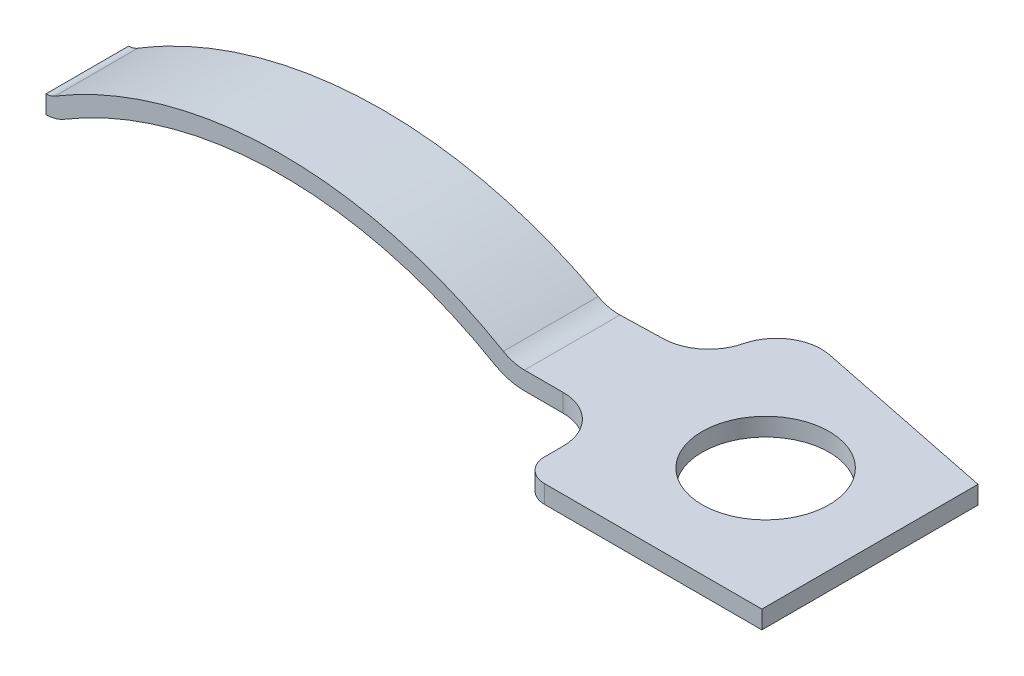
ISO-10303-21;
HEADER;
FILE_DESCRIPTION(('STEP AP214'),'2;1');
FILE_NAME('part.step','',(''),(''),'','','');
FILE_SCHEMA(('AUTOMOTIVE_DESIGN { 1 0 10303 214 1 1 1 1 }'));
ENDSEC;
DATA;
#1=APPLICATION_CONTEXT('core data for automotive mechanical design processes');
#2=APPLICATION_PROTOCOL_DEFINITION('international standard','automotive_design',2000,#1);
#3=PRODUCT_CONTEXT('',#1,'mechanical');
#4=PRODUCT('Part','Part','',(#3));
#5=PRODUCT_RELATED_PRODUCT_CATEGORY('part','',(#4));
#6=PRODUCT_DEFINITION_FORMATION('','',#4);
#7=PRODUCT_DEFINITION_CONTEXT('part definition',#1,'design');
#8=PRODUCT_DEFINITION('design','',#6,#7);
#9=PRODUCT_DEFINITION_SHAPE('','',#8);
#10=(LENGTH_UNIT() NAMED_UNIT(*) SI_UNIT(.MILLI.,.METRE.));
#11=(NAMED_UNIT(*) PLANE_ANGLE_UNIT() SI_UNIT($,.RADIAN.));
#12=(NAMED_UNIT(*) SI_UNIT($,.STERADIAN.) SOLID_ANGLE_UNIT());
#13=UNCERTAINTY_MEASURE_WITH_UNIT(LENGTH_MEASURE(1.E-05),#10,'distance_accuracy_value','');
#14=(GEOMETRIC_REPRESENTATION_CONTEXT(3) GLOBAL_UNCERTAINTY_ASSIGNED_CONTEXT((#13)) GLOBAL_UNIT_ASSIGNED_CONTEXT((#10,
#11,#12)) REPRESENTATION_CONTEXT('',''));
#15=CARTESIAN_POINT('',(0.,0.,0.));
#16=DIRECTION('',(0.,0.,1.));
#17=DIRECTION('',(1.,0.,0.));
#18=AXIS2_PLACEMENT_3D('',#15,#16,#17);
#19=CARTESIAN_POINT('',(-23.114,1.1938,-4.572));
#20=DIRECTION('',(0.,0.,1.));
#21=DIRECTION('',(1.,0.,0.));
#22=AXIS2_PLACEMENT_3D('',#19,#20,#21);
#23=CYLINDRICAL_SURFACE('',#22,1.1938);
#24=CARTESIAN_POINT('',(-23.114,1.1938,-1.5875));
#25=DIRECTION('',(0.0266571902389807,0.,0.999644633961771));
#26=DIRECTION('',(-0.999644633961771,0.,0.0266571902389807));
#27=AXIS2_PLACEMENT_3D('',#24,#25,#26);
#28=ELLIPSE('',#27,1.19422438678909,1.1938);
#29=CARTESIAN_POINT('',(-22.4993318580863,0.170402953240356,-1.60389115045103));
#30=VERTEX_POINT('',#29);
#31=CARTESIAN_POINT('',(-23.114,0.,-1.5875));
#32=VERTEX_POINT('',#31);
#33=EDGE_CURVE('E214',#30,#32,#28,.F.);
#34=ORIENTED_EDGE('',*,*,#33,.F.);
#35=DIRECTION('',(0.,0.,1.));
#36=VECTOR('',#35,1.);
#37=CARTESIAN_POINT('',(-22.4993318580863,0.170402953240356,-4.572));
#38=LINE('',#37,#36);
#39=CARTESIAN_POINT('',(-22.4993318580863,0.17040295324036,1.2065));
#40=VERTEX_POINT('',#39);
#41=EDGE_CURVE('E238',#30,#40,#38,.T.);
#42=ORIENTED_EDGE('',*,*,#41,.T.);
#43=CARTESIAN_POINT('',(-23.114,1.1938,1.2065));
#44=DIRECTION('',(0.,0.,-1.));
#45=DIRECTION('',(-1.,0.,0.));
#46=AXIS2_PLACEMENT_3D('',#43,#44,#45);
#47=CIRCLE('',#46,1.1938);
#48=CARTESIAN_POINT('',(-23.114,0.,1.2065));
#49=VERTEX_POINT('',#48);
#50=EDGE_CURVE('E201',#49,#40,#47,.F.);
#51=ORIENTED_EDGE('',*,*,#50,.F.);
#52=DIRECTION('',(0.,0.,1.));
#53=VECTOR('',#52,1.);
#54=CARTESIAN_POINT('',(-23.114,0.,-4.572));
#55=LINE('',#54,#53);
#56=EDGE_CURVE('E239',#32,#49,#55,.T.);
#57=ORIENTED_EDGE('',*,*,#56,.F.);
#58=EDGE_LOOP('',(#34,#42,#51,#57));
#59=FACE_BOUND('',#58,.T.);
#60=ADVANCED_FACE('F35',(#59),#23,.T.);
#61=CARTESIAN_POINT('',(-23.114,0.609599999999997,-4.572));
#62=DIRECTION('',(-1.,0.,0.));
#63=DIRECTION('',(0.,0.,1.));
#64=AXIS2_PLACEMENT_3D('',#61,#62,#63);
#65=PLANE('',#64);
#66=DIRECTION('',(0.,1.,0.));
#67=VECTOR('',#66,1.);
#68=CARTESIAN_POINT('',(-23.114,0.,-1.5875));
#69=LINE('',#68,#67);
#70=CARTESIAN_POINT('',(-23.114,0.609599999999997,-1.5875));
#71=VERTEX_POINT('',#70);
#72=EDGE_CURVE('E187',#32,#71,#69,.T.);
#73=ORIENTED_EDGE('',*,*,#72,.F.);
#74=ORIENTED_EDGE('',*,*,#56,.T.);
#75=DIRECTION('',(0.,1.,0.));
#76=VECTOR('',#75,1.);
#77=CARTESIAN_POINT('',(-23.114,0.,1.2065));
#78=LINE('',#77,#76);
#79=CARTESIAN_POINT('',(-23.114,0.609599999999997,1.2065));
#80=VERTEX_POINT('',#79);
#81=EDGE_CURVE('E190',#49,#80,#78,.T.);
#82=ORIENTED_EDGE('',*,*,#81,.T.);
#83=DIRECTION('',(0.,0.,1.));
#84=VECTOR('',#83,1.);
#85=CARTESIAN_POINT('',(-23.114,0.609599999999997,-4.572));
#86=LINE('',#85,#84);
#87=EDGE_CURVE('E243',#71,#80,#86,.T.);
#88=ORIENTED_EDGE('',*,*,#87,.F.);
#89=EDGE_LOOP('',(#73,#74,#82,#88));
#90=FACE_BOUND('',#89,.T.);
#91=ADVANCED_FACE('F329',(#90),#65,.T.);
#92=CARTESIAN_POINT('',(-23.114,1.1938,-4.572));
#93=DIRECTION('',(0.,0.,1.));
#94=DIRECTION('',(1.,0.,0.));
#95=AXIS2_PLACEMENT_3D('',#92,#93,#94);
#96=CYLINDRICAL_SURFACE('',#95,0.5842);
#97=CARTESIAN_POINT('',(-23.114,1.1938,-1.5875));
#98=DIRECTION('',(0.0266571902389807,0.,0.999644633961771));
#99=DIRECTION('',(-0.999644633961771,0.,0.0266571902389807));
#100=AXIS2_PLACEMENT_3D('',#97,#98,#99);
#101=ELLIPSE('',#100,0.584407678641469,0.5842);
#102=CARTESIAN_POINT('',(-22.8132049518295,0.69298867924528,-1.59552120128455));
#103=VERTEX_POINT('',#102);
#104=EDGE_CURVE('E223',#71,#103,#101,.T.);
#105=ORIENTED_EDGE('',*,*,#104,.F.);
#106=ORIENTED_EDGE('',*,*,#87,.T.);
#107=CARTESIAN_POINT('',(-23.114,1.1938,1.2065));
#108=DIRECTION('',(0.,0.,-1.));
#109=DIRECTION('',(-1.,0.,0.));
#110=AXIS2_PLACEMENT_3D('',#107,#108,#109);
#111=CIRCLE('',#110,0.5842);
#112=CARTESIAN_POINT('',(-22.8132049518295,0.69298867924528,1.2065));
#113=VERTEX_POINT('',#112);
#114=EDGE_CURVE('E210',#113,#80,#111,.T.);
#115=ORIENTED_EDGE('',*,*,#114,.F.);
#116=DIRECTION('',(0.,0.,1.));
#117=VECTOR('',#116,1.);
#118=CARTESIAN_POINT('',(-22.8132049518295,0.69298867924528,-4.572));
#119=LINE('',#118,#117);
#120=EDGE_CURVE('E246',#103,#113,#119,.T.);
#121=ORIENTED_EDGE('',*,*,#120,.F.);
#122=EDGE_LOOP('',(#105,#106,#115,#121));
#123=FACE_BOUND('',#122,.T.);
#124=ADVANCED_FACE('F335',(#123),#96,.F.);
#125=CARTESIAN_POINT('',(-15.1429312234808,-12.0777,-4.572));
#126=DIRECTION('',(0.,0.,1.));
#127=DIRECTION('',(1.,0.,0.));
#128=AXIS2_PLACEMENT_3D('',#125,#126,#127);
#129=CYLINDRICAL_SURFACE('',#128,14.8971);
#130=CARTESIAN_POINT('',(-15.1429312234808,-12.0777,-1.80006183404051));
#131=DIRECTION('',(0.0266571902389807,0.,0.999644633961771));
#132=DIRECTION('',(-0.999644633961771,0.,0.0266571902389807));
#133=AXIS2_PLACEMENT_3D('',#130,#131,#132);
#134=ELLIPSE('',#133,14.9023958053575,14.8971);
#135=CARTESIAN_POINT('',(-7.65750324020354,0.802205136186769,-1.99967324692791));
#136=VERTEX_POINT('',#135);
#137=EDGE_CURVE('E221',#103,#136,#134,.F.);
#138=ORIENTED_EDGE('',*,*,#137,.F.);
#139=ORIENTED_EDGE('',*,*,#120,.T.);
#140=CARTESIAN_POINT('',(-15.1429312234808,-12.0777,1.2065));
#141=DIRECTION('',(0.,0.,-1.));
#142=DIRECTION('',(-1.,0.,0.));
#143=AXIS2_PLACEMENT_3D('',#140,#141,#142);
#144=CIRCLE('',#143,14.8971);
#145=CARTESIAN_POINT('',(-7.65750324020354,0.802205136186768,1.2065));
#146=VERTEX_POINT('',#145);
#147=EDGE_CURVE('E208',#146,#113,#144,.F.);
#148=ORIENTED_EDGE('',*,*,#147,.F.);
#149=DIRECTION('',(0.,0.,1.));
#150=VECTOR('',#149,1.);
#151=CARTESIAN_POINT('',(-7.65750324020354,0.802205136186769,-4.572));
#152=LINE('',#151,#150);
#153=EDGE_CURVE('E249',#136,#146,#152,.T.);
#154=ORIENTED_EDGE('',*,*,#153,.F.);
#155=EDGE_LOOP('',(#138,#139,#148,#154));
#156=FACE_BOUND('',#155,.T.);
#157=ADVANCED_FACE('F363',(#156),#129,.T.);
#158=CARTESIAN_POINT('',(-6.94278206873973,2.032,-4.572));
#159=DIRECTION('',(0.,0.,1.));
#160=DIRECTION('',(1.,0.,0.));
#161=AXIS2_PLACEMENT_3D('',#158,#159,#160);
#162=CYLINDRICAL_SURFACE('',#161,1.4224);
#163=CARTESIAN_POINT('',(-6.94278206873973,2.032,-2.01873247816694));
#164=DIRECTION('',(0.0266571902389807,0.,0.999644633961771));
#165=DIRECTION('',(-0.999644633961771,0.,0.0266571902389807));
#166=AXIS2_PLACEMENT_3D('',#163,#164,#165);
#167=ELLIPSE('',#166,1.42290565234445,1.4224);
#168=CARTESIAN_POINT('',(-6.94278206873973,0.609599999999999,-2.01873247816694));
#169=VERTEX_POINT('',#168);
#170=EDGE_CURVE('E219',#136,#169,#167,.T.);
#171=ORIENTED_EDGE('',*,*,#170,.F.);
#172=ORIENTED_EDGE('',*,*,#153,.T.);
#173=CARTESIAN_POINT('',(-6.94278206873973,2.032,1.2065));
#174=DIRECTION('',(0.,0.,-1.));
#175=DIRECTION('',(-1.,0.,0.));
#176=AXIS2_PLACEMENT_3D('',#173,#174,#175);
#177=CIRCLE('',#176,1.4224);
#178=CARTESIAN_POINT('',(-6.94278206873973,0.609599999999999,1.2065));
#179=VERTEX_POINT('',#178);
#180=EDGE_CURVE('E205',#179,#146,#177,.T.);
#181=ORIENTED_EDGE('',*,*,#180,.F.);
#182=DIRECTION('',(0.,0.,1.));
#183=VECTOR('',#182,1.);
#184=CARTESIAN_POINT('',(-6.94278206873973,0.609599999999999,-4.572));
#185=LINE('',#184,#183);
#186=EDGE_CURVE('E252',#169,#179,#185,.T.);
#187=ORIENTED_EDGE('',*,*,#186,.F.);
#188=EDGE_LOOP('',(#171,#172,#181,#187));
#189=FACE_BOUND('',#188,.T.);
#190=ADVANCED_FACE('F367',(#189),#162,.F.);
#191=CARTESIAN_POINT('',(-6.94278206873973,0.609599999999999,-4.572));
#192=DIRECTION('',(0.,1.,0.));
#193=DIRECTION('',(-1.,0.,0.));
#194=AXIS2_PLACEMENT_3D('',#191,#192,#193);
#195=PLANE('',#194);
#196=DIRECTION('',(0.,0.,-1.));
#197=VECTOR('',#196,1.);
#198=CARTESIAN_POINT('',(-4.064,0.609599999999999,-4.572));
#199=LINE('',#198,#197);
#200=CARTESIAN_POINT('',(-4.064,0.609599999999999,3.4036));
#201=VERTEX_POINT('',#200);
#202=CARTESIAN_POINT('',(-4.064,0.609599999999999,2.7813));
#203=VERTEX_POINT('',#202);
#204=EDGE_CURVE('E196',#201,#203,#199,.T.);
#205=ORIENTED_EDGE('',*,*,#204,.F.);
#206=CARTESIAN_POINT('',(-3.2766,0.609599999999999,3.4036));
#207=DIRECTION('',(0.,1.,0.));
#208=DIRECTION('',(-1.,0.,0.));
#209=AXIS2_PLACEMENT_3D('',#206,#207,#208);
#210=CIRCLE('',#209,0.7874);
#211=CARTESIAN_POINT('',(-3.2766,0.609599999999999,4.191));
#212=VERTEX_POINT('',#211);
#213=EDGE_CURVE('E57',#201,#212,#210,.T.);
#214=ORIENTED_EDGE('',*,*,#213,.T.);
#215=DIRECTION('',(-1.,0.,0.));
#216=VECTOR('',#215,1.);
#217=CARTESIAN_POINT('',(-6.94278206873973,0.609599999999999,4.191));
#218=LINE('',#217,#216);
#219=CARTESIAN_POINT('',(4.064,0.6096,4.191));
#220=VERTEX_POINT('',#219);
#221=EDGE_CURVE('E236',#220,#212,#218,.T.);
#222=ORIENTED_EDGE('',*,*,#221,.F.);
#223=DIRECTION('',(0.,0.,1.));
#224=VECTOR('',#223,1.);
#225=CARTESIAN_POINT('',(4.064,0.6096,-4.572));
#226=LINE('',#225,#224);
#227=CARTESIAN_POINT('',(4.064,0.6096,-3.11306440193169));
#228=VERTEX_POINT('',#227);
#229=EDGE_CURVE('E255',#228,#220,#226,.T.);
#230=ORIENTED_EDGE('',*,*,#229,.F.);
#231=DIRECTION('',(0.979924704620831,0.,0.19936793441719));
#232=VECTOR('',#231,1.);
#233=CARTESIAN_POINT('',(-6.79031496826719,0.609599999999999,-5.32139974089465));
#234=LINE('',#233,#232);
#235=CARTESIAN_POINT('',(-2.23616326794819,0.6096,-4.39484710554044));
#236=VERTEX_POINT('',#235);
#237=EDGE_CURVE('E228',#236,#228,#234,.T.);
#238=ORIENTED_EDGE('',*,*,#237,.F.);
#239=CARTESIAN_POINT('',(-2.54,0.609599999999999,-2.90144185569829));
#240=DIRECTION('',(0.,1.,0.));
#241=DIRECTION('',(-1.,0.,0.));
#242=AXIS2_PLACEMENT_3D('',#239,#240,#241);
#243=CIRCLE('',#242,1.524);
#244=CARTESIAN_POINT('',(-4.02113889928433,0.609599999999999,-3.26033398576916));
#245=VERTEX_POINT('',#244);
#246=EDGE_CURVE('E172',#245,#236,#243,.F.);
#247=ORIENTED_EDGE('',*,*,#246,.F.);
#248=CARTESIAN_POINT('',(-5.55164909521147,0.609599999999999,-3.63118918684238));
#249=DIRECTION('',(0.,1.,0.));
#250=DIRECTION('',(-1.,0.,0.));
#251=AXIS2_PLACEMENT_3D('',#248,#249,#250);
#252=CIRCLE('',#251,1.5748);
#253=CARTESIAN_POINT('',(-5.50966935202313,0.609599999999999,-2.05694881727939));
#254=VERTEX_POINT('',#253);
#255=EDGE_CURVE('E280',#245,#254,#252,.F.);
#256=ORIENTED_EDGE('',*,*,#255,.T.);
#257=DIRECTION('',(0.999644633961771,0.,-0.0266571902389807));
#258=VECTOR('',#257,1.);
#259=CARTESIAN_POINT('',(-6.87474331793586,0.609599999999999,-2.02054684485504));
#260=LINE('',#259,#258);
#261=EDGE_CURVE('E216',#169,#254,#260,.T.);
#262=ORIENTED_EDGE('',*,*,#261,.F.);
#263=ORIENTED_EDGE('',*,*,#186,.T.);
#264=DIRECTION('',(-1.,0.,0.));
#265=VECTOR('',#264,1.);
#266=CARTESIAN_POINT('',(-6.94278206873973,0.609599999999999,1.2065));
#267=LINE('',#266,#265);
#268=CARTESIAN_POINT('',(-5.6388,0.609599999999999,1.2065));
#269=VERTEX_POINT('',#268);
#270=EDGE_CURVE('E203',#269,#179,#267,.T.);
#271=ORIENTED_EDGE('',*,*,#270,.F.);
#272=CARTESIAN_POINT('',(-5.6388,0.609599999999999,2.7813));
#273=DIRECTION('',(0.,1.,0.));
#274=DIRECTION('',(-1.,0.,0.));
#275=AXIS2_PLACEMENT_3D('',#272,#273,#274);
#276=CIRCLE('',#275,1.5748);
#277=EDGE_CURVE('E283',#269,#203,#276,.F.);
#278=ORIENTED_EDGE('',*,*,#277,.T.);
#279=EDGE_LOOP('',(#205,#214,#222,#230,#238,#247,#256,#262,#263,#271,#278));
#280=FACE_BOUND('',#279,.T.);
#281=CARTESIAN_POINT('',(0.,0.6096,0.));
#282=DIRECTION('',(0.,1.,0.));
#283=DIRECTION('',(-1.,0.,0.));
#284=AXIS2_PLACEMENT_3D('',#281,#282,#283);
#285=CIRCLE('',#284,2.1463);
#286=CARTESIAN_POINT('',(-2.1463,0.609599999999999,0.));
#287=VERTEX_POINT('',#286);
#288=EDGE_CURVE('E225',#287,#287,#285,.T.);
#289=ORIENTED_EDGE('',*,*,#288,.F.);
#290=EDGE_LOOP('',(#289));
#291=FACE_BOUND('',#290,.T.);
#292=ADVANCED_FACE('F297',(#280,#291),#195,.T.);
#293=CARTESIAN_POINT('',(4.064,0.6096,-4.572));
#294=DIRECTION('',(1.,0.,0.));
#295=DIRECTION('',(0.,0.,-1.));
#296=AXIS2_PLACEMENT_3D('',#293,#294,#295);
#297=PLANE('',#296);
#298=DIRECTION('',(0.,1.,0.));
#299=VECTOR('',#298,1.);
#300=CARTESIAN_POINT('',(4.064,0.,-3.11306440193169));
#301=LINE('',#300,#299);
#302=CARTESIAN_POINT('',(4.064,0.,-3.11306440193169));
#303=VERTEX_POINT('',#302);
#304=EDGE_CURVE('E175',#303,#228,#301,.T.);
#305=ORIENTED_EDGE('',*,*,#304,.T.);
#306=ORIENTED_EDGE('',*,*,#229,.T.);
#307=DIRECTION('',(0.,1.,0.));
#308=VECTOR('',#307,1.);
#309=CARTESIAN_POINT('',(4.064,0.6096,4.191));
#310=LINE('',#309,#308);
#311=CARTESIAN_POINT('',(4.064,0.,4.191));
#312=VERTEX_POINT('',#311);
#313=EDGE_CURVE('E233',#312,#220,#310,.T.);
#314=ORIENTED_EDGE('',*,*,#313,.F.);
#315=DIRECTION('',(0.,0.,1.));
#316=VECTOR('',#315,1.);
#317=CARTESIAN_POINT('',(4.064,0.,-4.572));
#318=LINE('',#317,#316);
#319=EDGE_CURVE('E257',#303,#312,#318,.T.);
#320=ORIENTED_EDGE('',*,*,#319,.F.);
#321=EDGE_LOOP('',(#305,#306,#314,#320));
#322=FACE_BOUND('',#321,.T.);
#323=ADVANCED_FACE('F322',(#322),#297,.T.);
#324=CARTESIAN_POINT('',(-6.94278206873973,0.,-4.572));
#325=DIRECTION('',(0.,-1.,0.));
#326=DIRECTION('',(1.,0.,0.));
#327=AXIS2_PLACEMENT_3D('',#324,#325,#326);
#328=PLANE('',#327);
#329=DIRECTION('',(1.,0.,0.));
#330=VECTOR('',#329,1.);
#331=CARTESIAN_POINT('',(-6.94278206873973,0.,4.191));
#332=LINE('',#331,#330);
#333=CARTESIAN_POINT('',(-3.2766,0.,4.191));
#334=VERTEX_POINT('',#333);
#335=EDGE_CURVE('E231',#334,#312,#332,.T.);
#336=ORIENTED_EDGE('',*,*,#335,.F.);
#337=CARTESIAN_POINT('',(-3.2766,0.,3.4036));
#338=DIRECTION('',(0.,-1.,0.));
#339=DIRECTION('',(1.,0.,0.));
#340=AXIS2_PLACEMENT_3D('',#337,#338,#339);
#341=CIRCLE('',#340,0.7874);
#342=CARTESIAN_POINT('',(-4.064,0.,3.4036));
#343=VERTEX_POINT('',#342);
#344=EDGE_CURVE('E11',#334,#343,#341,.T.);
#345=ORIENTED_EDGE('',*,*,#344,.T.);
#346=DIRECTION('',(0.,0.,-1.));
#347=VECTOR('',#346,1.);
#348=CARTESIAN_POINT('',(-4.064,0.,1.2065));
#349=LINE('',#348,#347);
#350=CARTESIAN_POINT('',(-4.064,0.,2.7813));
#351=VERTEX_POINT('',#350);
#352=EDGE_CURVE('E180',#343,#351,#349,.T.);
#353=ORIENTED_EDGE('',*,*,#352,.T.);
#354=CARTESIAN_POINT('',(-5.6388,0.,2.7813));
#355=DIRECTION('',(0.,-1.,0.));
#356=DIRECTION('',(1.,0.,0.));
#357=AXIS2_PLACEMENT_3D('',#354,#355,#356);
#358=CIRCLE('',#357,1.5748);
#359=CARTESIAN_POINT('',(-5.6388,0.,1.2065));
#360=VERTEX_POINT('',#359);
#361=EDGE_CURVE('E286',#351,#360,#358,.F.);
#362=ORIENTED_EDGE('',*,*,#361,.T.);
#363=DIRECTION('',(-1.,0.,0.));
#364=VECTOR('',#363,1.);
#365=CARTESIAN_POINT('',(-4.064,0.,1.2065));
#366=LINE('',#365,#364);
#367=CARTESIAN_POINT('',(-6.94278206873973,0.,1.2065));
#368=VERTEX_POINT('',#367);
#369=EDGE_CURVE('E182',#360,#368,#366,.T.);
#370=ORIENTED_EDGE('',*,*,#369,.T.);
#371=DIRECTION('',(0.,0.,1.));
#372=VECTOR('',#371,1.);
#373=CARTESIAN_POINT('',(-6.94278206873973,0.,-4.572));
#374=LINE('',#373,#372);
#375=CARTESIAN_POINT('',(-6.94278206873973,0.,-2.01873247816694));
#376=VERTEX_POINT('',#375);
#377=EDGE_CURVE('E259',#376,#368,#374,.T.);
#378=ORIENTED_EDGE('',*,*,#377,.F.);
#379=DIRECTION('',(0.999644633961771,0.,-0.0266571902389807));
#380=VECTOR('',#379,1.);
#381=CARTESIAN_POINT('',(-23.114,0.,-1.5875));
#382=LINE('',#381,#380);
#383=CARTESIAN_POINT('',(-5.50966935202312,0.,-2.05694881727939));
#384=VERTEX_POINT('',#383);
#385=EDGE_CURVE('E176',#376,#384,#382,.T.);
#386=ORIENTED_EDGE('',*,*,#385,.T.);
#387=CARTESIAN_POINT('',(-5.55164909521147,0.,-3.63118918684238));
#388=DIRECTION('',(0.,-1.,0.));
#389=DIRECTION('',(1.,0.,0.));
#390=AXIS2_PLACEMENT_3D('',#387,#388,#389);
#391=CIRCLE('',#390,1.5748);
#392=CARTESIAN_POINT('',(-4.02113889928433,0.,-3.26033398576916));
#393=VERTEX_POINT('',#392);
#394=EDGE_CURVE('E163',#384,#393,#391,.F.);
#395=ORIENTED_EDGE('',*,*,#394,.T.);
#396=CARTESIAN_POINT('',(-2.54,0.,-2.90144185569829));
#397=DIRECTION('',(0.,-1.,0.));
#398=DIRECTION('',(-1.,0.,0.));
#399=AXIS2_PLACEMENT_3D('',#396,#397,#398);
#400=CIRCLE('',#399,1.524);
#401=CARTESIAN_POINT('',(-2.23616326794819,0.,-4.39484710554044));
#402=VERTEX_POINT('',#401);
#403=EDGE_CURVE('E153',#393,#402,#400,.T.);
#404=ORIENTED_EDGE('',*,*,#403,.T.);
#405=DIRECTION('',(0.979924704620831,0.,0.19936793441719));
#406=VECTOR('',#405,1.);
#407=CARTESIAN_POINT('',(4.064,0.,-3.11306440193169));
#408=LINE('',#407,#406);
#409=EDGE_CURVE('E159',#402,#303,#408,.T.);
#410=ORIENTED_EDGE('',*,*,#409,.T.);
#411=ORIENTED_EDGE('',*,*,#319,.T.);
#412=EDGE_LOOP('',(#336,#345,#353,#362,#370,#378,#386,#395,#404,#410,#411));
#413=FACE_BOUND('',#412,.T.);
#414=CARTESIAN_POINT('',(0.,0.,0.));
#415=DIRECTION('',(0.,1.,0.));
#416=DIRECTION('',(-1.,0.,0.));
#417=AXIS2_PLACEMENT_3D('',#414,#415,#416);
#418=CIRCLE('',#417,2.1463);
#419=CARTESIAN_POINT('',(-2.1463,0.,0.));
#420=VERTEX_POINT('',#419);
#421=EDGE_CURVE('E189',#420,#420,#418,.T.);
#422=ORIENTED_EDGE('',*,*,#421,.T.);
#423=EDGE_LOOP('',(#422));
#424=FACE_BOUND('',#423,.T.);
#425=ADVANCED_FACE('F155',(#413,#424),#328,.T.);
#426=CARTESIAN_POINT('',(-6.94278206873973,2.032,-4.572));
#427=DIRECTION('',(0.,0.,1.));
#428=DIRECTION('',(1.,0.,0.));
#429=AXIS2_PLACEMENT_3D('',#426,#427,#428);
#430=CYLINDRICAL_SURFACE('',#429,2.032);
#431=CARTESIAN_POINT('',(-6.94278206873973,2.032,-2.01873247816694));
#432=DIRECTION('',(0.0266571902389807,0.,0.999644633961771));
#433=DIRECTION('',(-0.999644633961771,0.,0.0266571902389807));
#434=AXIS2_PLACEMENT_3D('',#431,#432,#433);
#435=ELLIPSE('',#434,2.03272236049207,2.032);
#436=CARTESIAN_POINT('',(-7.96381231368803,0.275150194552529,-1.99150500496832));
#437=VERTEX_POINT('',#436);
#438=EDGE_CURVE('E212',#376,#437,#435,.F.);
#439=ORIENTED_EDGE('',*,*,#438,.F.);
#440=ORIENTED_EDGE('',*,*,#377,.T.);
#441=CARTESIAN_POINT('',(-6.94278206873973,2.032,1.2065));
#442=DIRECTION('',(0.,0.,-1.));
#443=DIRECTION('',(-1.,0.,0.));
#444=AXIS2_PLACEMENT_3D('',#441,#442,#443);
#445=CIRCLE('',#444,2.032);
#446=CARTESIAN_POINT('',(-7.96381231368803,0.275150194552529,1.2065));
#447=VERTEX_POINT('',#446);
#448=EDGE_CURVE('E198',#447,#368,#445,.F.);
#449=ORIENTED_EDGE('',*,*,#448,.F.);
#450=DIRECTION('',(0.,0.,1.));
#451=VECTOR('',#450,1.);
#452=CARTESIAN_POINT('',(-7.96381231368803,0.275150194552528,-4.572));
#453=LINE('',#452,#451);
#454=EDGE_CURVE('E262',#437,#447,#453,.T.);
#455=ORIENTED_EDGE('',*,*,#454,.F.);
#456=EDGE_LOOP('',(#439,#440,#449,#455));
#457=FACE_BOUND('',#456,.T.);
#458=ADVANCED_FACE('F314',(#457),#430,.T.);
#459=CARTESIAN_POINT('',(-15.1429312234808,-12.0777,-4.572));
#460=DIRECTION('',(0.,0.,1.));
#461=DIRECTION('',(1.,0.,0.));
#462=AXIS2_PLACEMENT_3D('',#459,#460,#461);
#463=CYLINDRICAL_SURFACE('',#462,14.2875);
#464=CARTESIAN_POINT('',(-15.1429312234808,-12.0777,-1.80006183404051));
#465=DIRECTION('',(0.0266571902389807,0.,0.999644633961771));
#466=DIRECTION('',(-0.999644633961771,0.,0.0266571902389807));
#467=AXIS2_PLACEMENT_3D('',#464,#465,#466);
#468=ELLIPSE('',#467,14.2925790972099,14.2875);
#469=EDGE_CURVE('E268',#437,#30,#468,.T.);
#470=ORIENTED_EDGE('',*,*,#469,.F.);
#471=ORIENTED_EDGE('',*,*,#454,.T.);
#472=CARTESIAN_POINT('',(-15.1429312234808,-12.0777,1.2065));
#473=DIRECTION('',(0.,0.,-1.));
#474=DIRECTION('',(-1.,0.,0.));
#475=AXIS2_PLACEMENT_3D('',#472,#473,#474);
#476=CIRCLE('',#475,14.2875);
#477=EDGE_CURVE('E242',#40,#447,#476,.T.);
#478=ORIENTED_EDGE('',*,*,#477,.F.);
#479=ORIENTED_EDGE('',*,*,#41,.F.);
#480=EDGE_LOOP('',(#470,#471,#478,#479));
#481=FACE_BOUND('',#480,.T.);
#482=ADVANCED_FACE('F341',(#481),#463,.F.);
#483=CARTESIAN_POINT('',(-23.114,1.1938,4.191));
#484=DIRECTION('',(0.,0.,1.));
#485=DIRECTION('',(1.,0.,0.));
#486=AXIS2_PLACEMENT_3D('',#483,#484,#485);
#487=PLANE('',#486);
#488=ORIENTED_EDGE('',*,*,#221,.T.);
#489=DIRECTION('',(0.,1.,0.));
#490=VECTOR('',#489,1.);
#491=CARTESIAN_POINT('',(-3.2766,0.,4.191));
#492=LINE('',#491,#490);
#493=EDGE_CURVE('E43',#212,#334,#492,.F.);
#494=ORIENTED_EDGE('',*,*,#493,.T.);
#495=ORIENTED_EDGE('',*,*,#335,.T.);
#496=ORIENTED_EDGE('',*,*,#313,.T.);
#497=EDGE_LOOP('',(#488,#494,#495,#496));
#498=FACE_BOUND('',#497,.T.);
#499=ADVANCED_FACE('F358',(#498),#487,.T.);
#500=CARTESIAN_POINT('',(-4.064,0.,1.2065));
#501=DIRECTION('',(1.,0.,0.));
#502=DIRECTION('',(0.,0.,-1.));
#503=AXIS2_PLACEMENT_3D('',#500,#501,#502);
#504=PLANE('',#503);
#505=ORIENTED_EDGE('',*,*,#352,.F.);
#506=DIRECTION('',(0.,1.,0.));
#507=VECTOR('',#506,1.);
#508=CARTESIAN_POINT('',(-4.064,0.6096,3.4036));
#509=LINE('',#508,#507);
#510=EDGE_CURVE('E288',#343,#201,#509,.T.);
#511=ORIENTED_EDGE('',*,*,#510,.T.);
#512=ORIENTED_EDGE('',*,*,#204,.T.);
#513=DIRECTION('',(0.,1.,0.));
#514=VECTOR('',#513,1.);
#515=CARTESIAN_POINT('',(-4.064,0.,2.7813));
#516=LINE('',#515,#514);
#517=EDGE_CURVE('E277',#203,#351,#516,.F.);
#518=ORIENTED_EDGE('',*,*,#517,.T.);
#519=EDGE_LOOP('',(#505,#511,#512,#518));
#520=FACE_BOUND('',#519,.T.);
#521=ADVANCED_FACE('F294',(#520),#504,.F.);
#522=CARTESIAN_POINT('',(-4.064,0.,1.2065));
#523=DIRECTION('',(0.,0.,-1.));
#524=DIRECTION('',(-1.,0.,0.));
#525=AXIS2_PLACEMENT_3D('',#522,#523,#524);
#526=PLANE('',#525);
#527=ORIENTED_EDGE('',*,*,#369,.F.);
#528=DIRECTION('',(0.,1.,0.));
#529=VECTOR('',#528,1.);
#530=CARTESIAN_POINT('',(-5.6388,0.609599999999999,1.2065));
#531=LINE('',#530,#529);
#532=EDGE_CURVE('E274',#360,#269,#531,.T.);
#533=ORIENTED_EDGE('',*,*,#532,.T.);
#534=ORIENTED_EDGE('',*,*,#270,.T.);
#535=ORIENTED_EDGE('',*,*,#180,.T.);
#536=ORIENTED_EDGE('',*,*,#147,.T.);
#537=ORIENTED_EDGE('',*,*,#114,.T.);
#538=ORIENTED_EDGE('',*,*,#81,.F.);
#539=ORIENTED_EDGE('',*,*,#50,.T.);
#540=ORIENTED_EDGE('',*,*,#477,.T.);
#541=ORIENTED_EDGE('',*,*,#448,.T.);
#542=EDGE_LOOP('',(#527,#533,#534,#535,#536,#537,#538,#539,#540,#541));
#543=FACE_BOUND('',#542,.T.);
#544=ADVANCED_FACE('F308',(#543),#526,.F.);
#545=CARTESIAN_POINT('',(-2.54,0.,-2.90144185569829));
#546=DIRECTION('',(0.,1.,0.));
#547=DIRECTION('',(-1.,0.,0.));
#548=AXIS2_PLACEMENT_3D('',#545,#546,#547);
#549=CYLINDRICAL_SURFACE('',#548,1.524);
#550=ORIENTED_EDGE('',*,*,#403,.F.);
#551=DIRECTION('',(0.,1.,0.));
#552=VECTOR('',#551,1.);
#553=CARTESIAN_POINT('',(-4.02113889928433,0.,-3.26033398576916));
#554=LINE('',#553,#552);
#555=EDGE_CURVE('E270',#393,#245,#554,.T.);
#556=ORIENTED_EDGE('',*,*,#555,.T.);
#557=ORIENTED_EDGE('',*,*,#246,.T.);
#558=DIRECTION('',(0.,1.,0.));
#559=VECTOR('',#558,1.);
#560=CARTESIAN_POINT('',(-2.23616326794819,0.,-4.39484710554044));
#561=LINE('',#560,#559);
#562=EDGE_CURVE('E169',#402,#236,#561,.T.);
#563=ORIENTED_EDGE('',*,*,#562,.F.);
#564=EDGE_LOOP('',(#550,#556,#557,#563));
#565=FACE_BOUND('',#564,.T.);
#566=ADVANCED_FACE('F170',(#565),#549,.T.);
#567=CARTESIAN_POINT('',(-23.114,0.,-1.5875));
#568=DIRECTION('',(0.0266571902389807,0.,0.999644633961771));
#569=DIRECTION('',(0.999644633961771,0.,-0.0266571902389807));
#570=AXIS2_PLACEMENT_3D('',#567,#568,#569);
#571=PLANE('',#570);
#572=ORIENTED_EDGE('',*,*,#261,.T.);
#573=DIRECTION('',(0.,-1.,0.));
#574=VECTOR('',#573,1.);
#575=CARTESIAN_POINT('',(-5.50966935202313,0.,-2.05694881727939));
#576=LINE('',#575,#574);
#577=EDGE_CURVE('E272',#254,#384,#576,.T.);
#578=ORIENTED_EDGE('',*,*,#577,.T.);
#579=ORIENTED_EDGE('',*,*,#385,.F.);
#580=ORIENTED_EDGE('',*,*,#438,.T.);
#581=ORIENTED_EDGE('',*,*,#469,.T.);
#582=ORIENTED_EDGE('',*,*,#33,.T.);
#583=ORIENTED_EDGE('',*,*,#72,.T.);
#584=ORIENTED_EDGE('',*,*,#104,.T.);
#585=ORIENTED_EDGE('',*,*,#137,.T.);
#586=ORIENTED_EDGE('',*,*,#170,.T.);
#587=EDGE_LOOP('',(#572,#578,#579,#580,#581,#582,#583,#584,#585,#586));
#588=FACE_BOUND('',#587,.T.);
#589=ADVANCED_FACE('F353',(#588),#571,.F.);
#590=CARTESIAN_POINT('',(4.064,0.,-3.11306440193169));
#591=DIRECTION('',(-0.19936793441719,0.,0.979924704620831));
#592=DIRECTION('',(0.979924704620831,0.,0.19936793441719));
#593=AXIS2_PLACEMENT_3D('',#590,#591,#592);
#594=PLANE('',#593);
#595=ORIENTED_EDGE('',*,*,#237,.T.);
#596=ORIENTED_EDGE('',*,*,#304,.F.);
#597=ORIENTED_EDGE('',*,*,#409,.F.);
#598=ORIENTED_EDGE('',*,*,#562,.T.);
#599=EDGE_LOOP('',(#595,#596,#597,#598));
#600=FACE_BOUND('',#599,.T.);
#601=ADVANCED_FACE('F178',(#600),#594,.F.);
#602=CARTESIAN_POINT('',(0.,0.,0.));
#603=DIRECTION('',(0.,1.,0.));
#604=DIRECTION('',(-1.,0.,0.));
#605=AXIS2_PLACEMENT_3D('',#602,#603,#604);
#606=CYLINDRICAL_SURFACE('',#605,2.1463);
#607=ORIENTED_EDGE('',*,*,#288,.T.);
#608=EDGE_LOOP('',(#607));
#609=FACE_BOUND('',#608,.T.);
#610=ORIENTED_EDGE('',*,*,#421,.F.);
#611=EDGE_LOOP('',(#610));
#612=FACE_BOUND('',#611,.T.);
#613=ADVANCED_FACE('F344',(#609,#612),#606,.F.);
#614=CARTESIAN_POINT('',(-5.55164909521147,0.,-3.63118918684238));
#615=DIRECTION('',(0.,1.,0.));
#616=DIRECTION('',(-1.,0.,0.));
#617=AXIS2_PLACEMENT_3D('',#614,#615,#616);
#618=CYLINDRICAL_SURFACE('',#617,1.5748);
#619=ORIENTED_EDGE('',*,*,#394,.F.);
#620=ORIENTED_EDGE('',*,*,#577,.F.);
#621=ORIENTED_EDGE('',*,*,#255,.F.);
#622=ORIENTED_EDGE('',*,*,#555,.F.);
#623=EDGE_LOOP('',(#619,#620,#621,#622));
#624=FACE_BOUND('',#623,.T.);
#625=ADVANCED_FACE('F318',(#624),#618,.F.);
#626=CARTESIAN_POINT('',(-5.6388,0.,2.7813));
#627=DIRECTION('',(0.,-1.,0.));
#628=DIRECTION('',(1.,0.,0.));
#629=AXIS2_PLACEMENT_3D('',#626,#627,#628);
#630=CYLINDRICAL_SURFACE('',#629,1.5748);
#631=ORIENTED_EDGE('',*,*,#361,.F.);
#632=ORIENTED_EDGE('',*,*,#517,.F.);
#633=ORIENTED_EDGE('',*,*,#277,.F.);
#634=ORIENTED_EDGE('',*,*,#532,.F.);
#635=EDGE_LOOP('',(#631,#632,#633,#634));
#636=FACE_BOUND('',#635,.T.);
#637=ADVANCED_FACE('F304',(#636),#630,.F.);
#638=CARTESIAN_POINT('',(-3.2766,0.,3.4036));
#639=DIRECTION('',(0.,-1.,0.));
#640=DIRECTION('',(1.,0.,0.));
#641=AXIS2_PLACEMENT_3D('',#638,#639,#640);
#642=CYLINDRICAL_SURFACE('',#641,0.7874);
#643=ORIENTED_EDGE('',*,*,#344,.F.);
#644=ORIENTED_EDGE('',*,*,#493,.F.);
#645=ORIENTED_EDGE('',*,*,#213,.F.);
#646=ORIENTED_EDGE('',*,*,#510,.F.);
#647=EDGE_LOOP('',(#643,#644,#645,#646));
#648=FACE_BOUND('',#647,.T.);
#649=ADVANCED_FACE('F37',(#648),#642,.T.);
#650=CLOSED_SHELL('',(#60,#91,#124,#157,#190,#292,#323,#425,#458,#482,#499,#521,#544,#566,#589,
#601,#613,#625,#637,#649));
#651=MANIFOLD_SOLID_BREP('B2',#650);
#652=ADVANCED_BREP_SHAPE_REPRESENTATION('',(#18,#651),#14);
#653=SHAPE_DEFINITION_REPRESENTATION(#9,#652);
ENDSEC;
END-ISO-10303-21;
